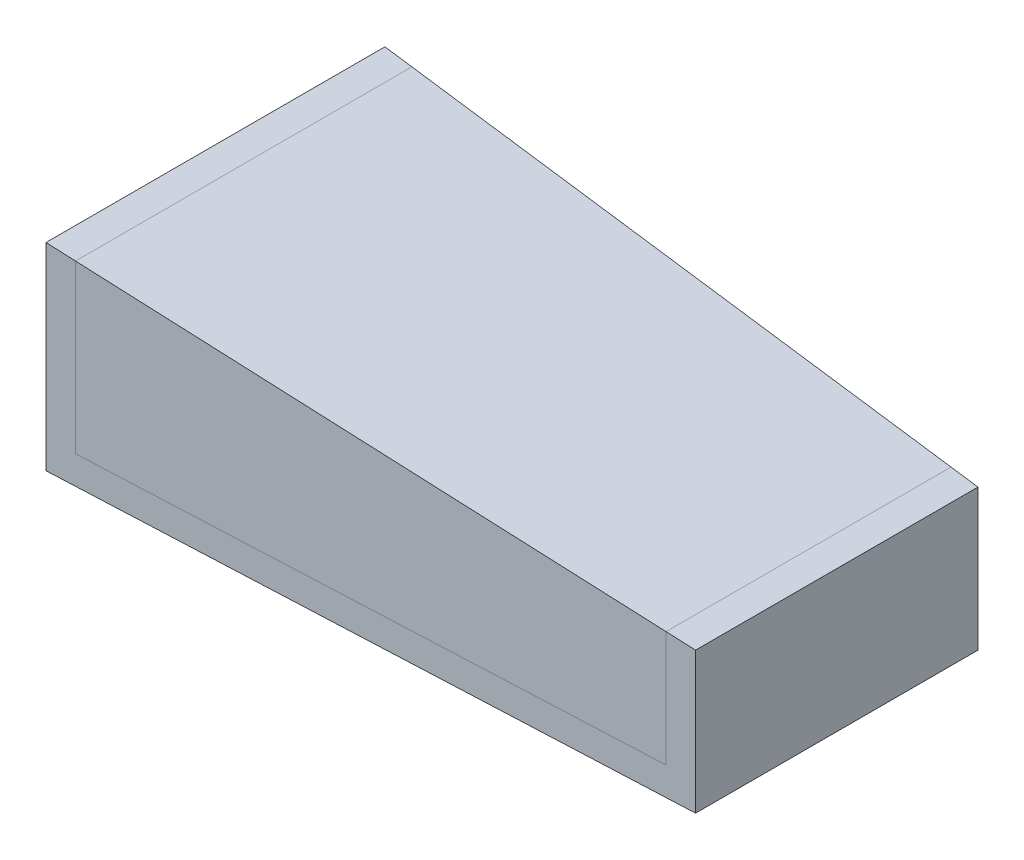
ISO-10303-21;
HEADER;
FILE_DESCRIPTION(('STEP AP214'),'2;1');
FILE_NAME('part.step','',(''),(''),'','','');
FILE_SCHEMA(('AUTOMOTIVE_DESIGN { 1 0 10303 214 1 1 1 1 }'));
ENDSEC;
DATA;
#1=APPLICATION_CONTEXT('core data for automotive mechanical design processes');
#2=APPLICATION_PROTOCOL_DEFINITION('international standard','automotive_design',2000,#1);
#3=PRODUCT_CONTEXT('',#1,'mechanical');
#4=PRODUCT('Part','Part','',(#3));
#5=PRODUCT_RELATED_PRODUCT_CATEGORY('part','',(#4));
#6=PRODUCT_DEFINITION_FORMATION('','',#4);
#7=PRODUCT_DEFINITION_CONTEXT('part definition',#1,'design');
#8=PRODUCT_DEFINITION('design','',#6,#7);
#9=PRODUCT_DEFINITION_SHAPE('','',#8);
#10=(LENGTH_UNIT() NAMED_UNIT(*) SI_UNIT(.MILLI.,.METRE.));
#11=(NAMED_UNIT(*) PLANE_ANGLE_UNIT() SI_UNIT($,.RADIAN.));
#12=(NAMED_UNIT(*) SI_UNIT($,.STERADIAN.) SOLID_ANGLE_UNIT());
#13=UNCERTAINTY_MEASURE_WITH_UNIT(LENGTH_MEASURE(1.E-05),#10,'distance_accuracy_value','');
#14=(GEOMETRIC_REPRESENTATION_CONTEXT(3) GLOBAL_UNCERTAINTY_ASSIGNED_CONTEXT((#13)) GLOBAL_UNIT_ASSIGNED_CONTEXT((#10,
#11,#12)) REPRESENTATION_CONTEXT('',''));
#15=CARTESIAN_POINT('',(0.,0.,0.));
#16=DIRECTION('',(0.,0.,1.));
#17=DIRECTION('',(1.,0.,0.));
#18=AXIS2_PLACEMENT_3D('',#15,#16,#17);
#19=CARTESIAN_POINT('',(9.99999999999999,10.,60.01));
#20=DIRECTION('',(0.,-1.,0.));
#21=DIRECTION('',(1.,0.,0.));
#22=AXIS2_PLACEMENT_3D('',#19,#20,#21);
#23=PLANE('',#22);
#24=DIRECTION('',(0.,0.,-1.));
#25=VECTOR('',#24,1.);
#26=CARTESIAN_POINT('',(210.,9.99999999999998,60.01));
#27=LINE('',#26,#25);
#28=CARTESIAN_POINT('',(210.,9.99999999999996,50.4545454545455));
#29=VERTEX_POINT('',#28);
#30=CARTESIAN_POINT('',(210.,9.99999999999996,-50.4545454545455));
#31=VERTEX_POINT('',#30);
#32=EDGE_CURVE('E12',#29,#31,#27,.T.);
#33=ORIENTED_EDGE('',*,*,#32,.F.);
#34=DIRECTION('',(-0.9989685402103,0.,0.04540766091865));
#35=VECTOR('',#34,1.);
#36=CARTESIAN_POINT('',(0.,9.99999999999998,60.));
#37=LINE('',#36,#35);
#38=CARTESIAN_POINT('',(9.99999999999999,9.99999999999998,59.5454545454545));
#39=VERTEX_POINT('',#38);
#40=EDGE_CURVE('E120',#29,#39,#37,.T.);
#41=ORIENTED_EDGE('',*,*,#40,.T.);
#42=DIRECTION('',(0.,0.,-1.));
#43=VECTOR('',#42,1.);
#44=CARTESIAN_POINT('',(9.99999999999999,10.,60.01));
#45=LINE('',#44,#43);
#46=CARTESIAN_POINT('',(9.99999999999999,9.99999999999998,-59.5454545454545));
#47=VERTEX_POINT('',#46);
#48=EDGE_CURVE('E64',#39,#47,#45,.T.);
#49=ORIENTED_EDGE('',*,*,#48,.T.);
#50=DIRECTION('',(-0.9989685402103,0.,-0.04540766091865));
#51=VECTOR('',#50,1.);
#52=CARTESIAN_POINT('',(0.,9.99999999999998,-60.));
#53=LINE('',#52,#51);
#54=EDGE_CURVE('E109',#31,#47,#53,.T.);
#55=ORIENTED_EDGE('',*,*,#54,.F.);
#56=EDGE_LOOP('',(#33,#41,#49,#55));
#57=FACE_BOUND('',#56,.T.);
#58=ADVANCED_FACE('F55',(#57),#23,.T.);
#59=CARTESIAN_POINT('',(210.,96.0285723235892,60.01));
#60=DIRECTION('',(1.,0.,0.));
#61=DIRECTION('',(0.,0.,-1.));
#62=AXIS2_PLACEMENT_3D('',#59,#60,#61);
#63=PLANE('',#62);
#64=DIRECTION('',(0.,0.,1.));
#65=VECTOR('',#64,1.);
#66=CARTESIAN_POINT('',(210.,50.9090909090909,60.));
#67=LINE('',#66,#65);
#68=CARTESIAN_POINT('',(210.,50.9090909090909,-50.4545454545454));
#69=VERTEX_POINT('',#68);
#70=CARTESIAN_POINT('',(210.,50.9090909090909,50.4545454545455));
#71=VERTEX_POINT('',#70);
#72=EDGE_CURVE('E114',#69,#71,#67,.T.);
#73=ORIENTED_EDGE('',*,*,#72,.T.);
#74=DIRECTION('',(0.,-1.,0.));
#75=VECTOR('',#74,1.);
#76=CARTESIAN_POINT('',(210.,120.,50.4545454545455));
#77=LINE('',#76,#75);
#78=EDGE_CURVE('E107',#71,#29,#77,.T.);
#79=ORIENTED_EDGE('',*,*,#78,.T.);
#80=ORIENTED_EDGE('',*,*,#32,.T.);
#81=DIRECTION('',(0.,-1.,0.));
#82=VECTOR('',#81,1.);
#83=CARTESIAN_POINT('',(210.,120.,-50.4545454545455));
#84=LINE('',#83,#82);
#85=EDGE_CURVE('E79',#69,#31,#84,.T.);
#86=ORIENTED_EDGE('',*,*,#85,.F.);
#87=EDGE_LOOP('',(#73,#79,#80,#86));
#88=FACE_BOUND('',#87,.T.);
#89=ADVANCED_FACE('F125',(#88),#63,.T.);
#90=CARTESIAN_POINT('',(10.,96.0285723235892,60.01));
#91=DIRECTION('',(-1.,0.,0.));
#92=DIRECTION('',(0.,-1.,0.));
#93=AXIS2_PLACEMENT_3D('',#90,#91,#92);
#94=PLANE('',#93);
#95=ORIENTED_EDGE('',*,*,#48,.F.);
#96=DIRECTION('',(0.,1.,0.));
#97=VECTOR('',#96,1.);
#98=CARTESIAN_POINT('',(10.,120.,59.5454545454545));
#99=LINE('',#98,#97);
#100=CARTESIAN_POINT('',(10.,69.0909090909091,59.5454545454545));
#101=VERTEX_POINT('',#100);
#102=EDGE_CURVE('E105',#39,#101,#99,.T.);
#103=ORIENTED_EDGE('',*,*,#102,.T.);
#104=DIRECTION('',(0.,0.,-1.));
#105=VECTOR('',#104,1.);
#106=CARTESIAN_POINT('',(10.,69.0909090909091,60.));
#107=LINE('',#106,#105);
#108=CARTESIAN_POINT('',(10.,69.0909090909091,-59.5454545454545));
#109=VERTEX_POINT('',#108);
#110=EDGE_CURVE('E111',#101,#109,#107,.T.);
#111=ORIENTED_EDGE('',*,*,#110,.T.);
#112=DIRECTION('',(0.,1.,0.));
#113=VECTOR('',#112,1.);
#114=CARTESIAN_POINT('',(10.,120.,-59.5454545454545));
#115=LINE('',#114,#113);
#116=EDGE_CURVE('E72',#47,#109,#115,.T.);
#117=ORIENTED_EDGE('',*,*,#116,.F.);
#118=EDGE_LOOP('',(#95,#103,#111,#117));
#119=FACE_BOUND('',#118,.T.);
#120=ADVANCED_FACE('F116',(#119),#94,.T.);
#121=CARTESIAN_POINT('',(0.,70.,60.));
#122=DIRECTION('',(-0.0905357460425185,-0.995893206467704,0.));
#123=DIRECTION('',(0.995893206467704,-0.0905357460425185,0.));
#124=AXIS2_PLACEMENT_3D('',#121,#122,#123);
#125=PLANE('',#124);
#126=ORIENTED_EDGE('',*,*,#110,.F.);
#127=DIRECTION('',(0.994874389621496,-0.0904431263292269,-0.0452215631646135));
#128=VECTOR('',#127,1.);
#129=CARTESIAN_POINT('',(0.,70.,60.));
#130=LINE('',#129,#128);
#131=EDGE_CURVE('E100',#101,#71,#130,.T.);
#132=ORIENTED_EDGE('',*,*,#131,.T.);
#133=ORIENTED_EDGE('',*,*,#72,.F.);
#134=DIRECTION('',(0.994874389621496,-0.0904431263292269,0.0452215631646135));
#135=VECTOR('',#134,1.);
#136=CARTESIAN_POINT('',(5.39877300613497,69.5092024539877,-59.7546012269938));
#137=LINE('',#136,#135);
#138=EDGE_CURVE('E59',#109,#69,#137,.T.);
#139=ORIENTED_EDGE('',*,*,#138,.F.);
#140=EDGE_LOOP('',(#126,#132,#133,#139));
#141=FACE_BOUND('',#140,.T.);
#142=ADVANCED_FACE('F112',(#141),#125,.F.);
#143=CARTESIAN_POINT('',(0.,120.,-60.));
#144=DIRECTION('',(0.04540766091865,0.,-0.9989685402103));
#145=DIRECTION('',(-0.9989685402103,0.,-0.04540766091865));
#146=AXIS2_PLACEMENT_3D('',#143,#144,#145);
#147=PLANE('',#146);
#148=ORIENTED_EDGE('',*,*,#54,.T.);
#149=ORIENTED_EDGE('',*,*,#116,.T.);
#150=ORIENTED_EDGE('',*,*,#138,.T.);
#151=ORIENTED_EDGE('',*,*,#85,.T.);
#152=EDGE_LOOP('',(#148,#149,#150,#151));
#153=FACE_BOUND('',#152,.T.);
#154=ADVANCED_FACE('F57',(#153),#147,.T.);
#155=CARTESIAN_POINT('',(0.,120.,60.));
#156=DIRECTION('',(-0.04540766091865,0.,-0.9989685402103));
#157=DIRECTION('',(-0.9989685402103,0.,0.04540766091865));
#158=AXIS2_PLACEMENT_3D('',#155,#156,#157);
#159=PLANE('',#158);
#160=ORIENTED_EDGE('',*,*,#102,.F.);
#161=ORIENTED_EDGE('',*,*,#40,.F.);
#162=ORIENTED_EDGE('',*,*,#78,.F.);
#163=ORIENTED_EDGE('',*,*,#131,.F.);
#164=EDGE_LOOP('',(#160,#161,#162,#163));
#165=FACE_BOUND('',#164,.T.);
#166=ADVANCED_FACE('F102',(#165),#159,.F.);
#167=CLOSED_SHELL('',(#58,#89,#120,#142,#154,#166));
#168=MANIFOLD_SOLID_BREP('B2',#167);
#169=CARTESIAN_POINT('',(9.99999999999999,10.,60.01));
#170=DIRECTION('',(0.,-1.,0.));
#171=DIRECTION('',(1.,0.,0.));
#172=AXIS2_PLACEMENT_3D('',#169,#170,#171);
#173=PLANE('',#172);
#174=DIRECTION('',(0.,0.,-1.));
#175=VECTOR('',#174,1.);
#176=CARTESIAN_POINT('',(210.,9.99999999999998,60.01));
#177=LINE('',#176,#175);
#178=CARTESIAN_POINT('',(210.,9.99999999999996,50.4545454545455));
#179=VERTEX_POINT('',#178);
#180=CARTESIAN_POINT('',(210.,9.99999999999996,-50.4545454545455));
#181=VERTEX_POINT('',#180);
#182=EDGE_CURVE('E53',#179,#181,#177,.T.);
#183=ORIENTED_EDGE('',*,*,#182,.T.);
#184=DIRECTION('',(-0.9989685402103,0.,-0.04540766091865));
#185=VECTOR('',#184,1.);
#186=CARTESIAN_POINT('',(0.,9.99999999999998,-60.));
#187=LINE('',#186,#185);
#188=CARTESIAN_POINT('',(9.99999999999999,9.99999999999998,-59.5454545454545));
#189=VERTEX_POINT('',#188);
#190=EDGE_CURVE('E286',#181,#189,#187,.T.);
#191=ORIENTED_EDGE('',*,*,#190,.T.);
#192=DIRECTION('',(0.,0.,-1.));
#193=VECTOR('',#192,1.);
#194=CARTESIAN_POINT('',(9.99999999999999,10.,60.01));
#195=LINE('',#194,#193);
#196=CARTESIAN_POINT('',(9.99999999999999,9.99999999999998,59.5454545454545));
#197=VERTEX_POINT('',#196);
#198=EDGE_CURVE('E192',#197,#189,#195,.T.);
#199=ORIENTED_EDGE('',*,*,#198,.F.);
#200=DIRECTION('',(-0.9989685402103,0.,0.04540766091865));
#201=VECTOR('',#200,1.);
#202=CARTESIAN_POINT('',(0.,9.99999999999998,60.));
#203=LINE('',#202,#201);
#204=EDGE_CURVE('E278',#179,#197,#203,.T.);
#205=ORIENTED_EDGE('',*,*,#204,.F.);
#206=EDGE_LOOP('',(#183,#191,#199,#205));
#207=FACE_BOUND('',#206,.T.);
#208=ADVANCED_FACE('F183',(#207),#173,.F.);
#209=CARTESIAN_POINT('',(210.,96.0285723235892,60.01));
#210=DIRECTION('',(1.,0.,0.));
#211=DIRECTION('',(0.,0.,-1.));
#212=AXIS2_PLACEMENT_3D('',#209,#210,#211);
#213=PLANE('',#212);
#214=DIRECTION('',(0.,0.,1.));
#215=VECTOR('',#214,1.);
#216=CARTESIAN_POINT('',(210.,50.9090909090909,60.));
#217=LINE('',#216,#215);
#218=CARTESIAN_POINT('',(210.,50.9090909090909,-50.4545454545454));
#219=VERTEX_POINT('',#218);
#220=CARTESIAN_POINT('',(210.,50.9090909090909,50.4545454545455));
#221=VERTEX_POINT('',#220);
#222=EDGE_CURVE('E295',#219,#221,#217,.T.);
#223=ORIENTED_EDGE('',*,*,#222,.F.);
#224=DIRECTION('',(0.,-1.,0.));
#225=VECTOR('',#224,1.);
#226=CARTESIAN_POINT('',(210.,120.,-50.4545454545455));
#227=LINE('',#226,#225);
#228=EDGE_CURVE('E208',#219,#181,#227,.T.);
#229=ORIENTED_EDGE('',*,*,#228,.T.);
#230=ORIENTED_EDGE('',*,*,#182,.F.);
#231=DIRECTION('',(0.,-1.,0.));
#232=VECTOR('',#231,1.);
#233=CARTESIAN_POINT('',(210.,120.,50.4545454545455));
#234=LINE('',#233,#232);
#235=EDGE_CURVE('E294',#221,#179,#234,.T.);
#236=ORIENTED_EDGE('',*,*,#235,.F.);
#237=EDGE_LOOP('',(#223,#229,#230,#236));
#238=FACE_BOUND('',#237,.T.);
#239=ADVANCED_FACE('F330',(#238),#213,.F.);
#240=CARTESIAN_POINT('',(10.,96.0285723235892,60.01));
#241=DIRECTION('',(-1.,0.,0.));
#242=DIRECTION('',(0.,-1.,0.));
#243=AXIS2_PLACEMENT_3D('',#240,#241,#242);
#244=PLANE('',#243);
#245=ORIENTED_EDGE('',*,*,#198,.T.);
#246=DIRECTION('',(0.,1.,0.));
#247=VECTOR('',#246,1.);
#248=CARTESIAN_POINT('',(10.,120.,-59.5454545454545));
#249=LINE('',#248,#247);
#250=CARTESIAN_POINT('',(10.,69.0909090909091,-59.5454545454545));
#251=VERTEX_POINT('',#250);
#252=EDGE_CURVE('E289',#189,#251,#249,.T.);
#253=ORIENTED_EDGE('',*,*,#252,.T.);
#254=DIRECTION('',(0.,0.,-1.));
#255=VECTOR('',#254,1.);
#256=CARTESIAN_POINT('',(10.,69.0909090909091,60.));
#257=LINE('',#256,#255);
#258=CARTESIAN_POINT('',(10.,69.0909090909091,59.5454545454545));
#259=VERTEX_POINT('',#258);
#260=EDGE_CURVE('E200',#259,#251,#257,.T.);
#261=ORIENTED_EDGE('',*,*,#260,.F.);
#262=DIRECTION('',(0.,1.,0.));
#263=VECTOR('',#262,1.);
#264=CARTESIAN_POINT('',(10.,120.,59.5454545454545));
#265=LINE('',#264,#263);
#266=EDGE_CURVE('E187',#197,#259,#265,.T.);
#267=ORIENTED_EDGE('',*,*,#266,.F.);
#268=EDGE_LOOP('',(#245,#253,#261,#267));
#269=FACE_BOUND('',#268,.T.);
#270=ADVANCED_FACE('F185',(#269),#244,.F.);
#271=CARTESIAN_POINT('',(0.,70.,60.));
#272=DIRECTION('',(-0.0905357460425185,-0.995893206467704,0.));
#273=DIRECTION('',(0.995893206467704,-0.0905357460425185,0.));
#274=AXIS2_PLACEMENT_3D('',#271,#272,#273);
#275=PLANE('',#274);
#276=DIRECTION('',(0.994874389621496,-0.0904431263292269,-0.0452215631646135));
#277=VECTOR('',#276,1.);
#278=CARTESIAN_POINT('',(0.,70.,60.));
#279=LINE('',#278,#277);
#280=CARTESIAN_POINT('',(0.,70.,60.));
#281=VERTEX_POINT('',#280);
#282=EDGE_CURVE('E304',#281,#259,#279,.T.);
#283=ORIENTED_EDGE('',*,*,#282,.T.);
#284=ORIENTED_EDGE('',*,*,#260,.T.);
#285=DIRECTION('',(0.994874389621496,-0.0904431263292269,0.0452215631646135));
#286=VECTOR('',#285,1.);
#287=CARTESIAN_POINT('',(5.39877300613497,69.5092024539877,-59.7546012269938));
#288=LINE('',#287,#286);
#289=CARTESIAN_POINT('',(0.,70.,-60.));
#290=VERTEX_POINT('',#289);
#291=EDGE_CURVE('E324',#290,#251,#288,.T.);
#292=ORIENTED_EDGE('',*,*,#291,.F.);
#293=DIRECTION('',(0.,0.,-1.));
#294=VECTOR('',#293,1.);
#295=CARTESIAN_POINT('',(0.,70.,60.));
#296=LINE('',#295,#294);
#297=EDGE_CURVE('E281',#281,#290,#296,.T.);
#298=ORIENTED_EDGE('',*,*,#297,.F.);
#299=EDGE_LOOP('',(#283,#284,#292,#298));
#300=FACE_BOUND('',#299,.T.);
#301=ADVANCED_FACE('F309',(#300),#275,.F.);
#302=CARTESIAN_POINT('',(0.,0.,60.));
#303=DIRECTION('',(0.,1.,0.));
#304=DIRECTION('',(0.,0.,1.));
#305=AXIS2_PLACEMENT_3D('',#302,#303,#304);
#306=PLANE('',#305);
#307=DIRECTION('',(0.9989685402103,0.,0.04540766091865));
#308=VECTOR('',#307,1.);
#309=CARTESIAN_POINT('',(0.,0.,-60.));
#310=LINE('',#309,#308);
#311=CARTESIAN_POINT('',(0.,0.,-60.));
#312=VERTEX_POINT('',#311);
#313=CARTESIAN_POINT('',(220.,0.,-50.));
#314=VERTEX_POINT('',#313);
#315=EDGE_CURVE('E254',#312,#314,#310,.T.);
#316=ORIENTED_EDGE('',*,*,#315,.T.);
#317=DIRECTION('',(0.,0.,-1.));
#318=VECTOR('',#317,1.);
#319=CARTESIAN_POINT('',(220.,0.,60.));
#320=LINE('',#319,#318);
#321=CARTESIAN_POINT('',(220.,0.,50.));
#322=VERTEX_POINT('',#321);
#323=EDGE_CURVE('E267',#322,#314,#320,.T.);
#324=ORIENTED_EDGE('',*,*,#323,.F.);
#325=DIRECTION('',(0.9989685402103,0.,-0.04540766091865));
#326=VECTOR('',#325,1.);
#327=CARTESIAN_POINT('',(0.,0.,60.));
#328=LINE('',#327,#326);
#329=CARTESIAN_POINT('',(0.,0.,60.));
#330=VERTEX_POINT('',#329);
#331=EDGE_CURVE('E323',#330,#322,#328,.T.);
#332=ORIENTED_EDGE('',*,*,#331,.F.);
#333=DIRECTION('',(0.,0.,-1.));
#334=VECTOR('',#333,1.);
#335=CARTESIAN_POINT('',(0.,0.,60.));
#336=LINE('',#335,#334);
#337=EDGE_CURVE('E269',#330,#312,#336,.T.);
#338=ORIENTED_EDGE('',*,*,#337,.T.);
#339=EDGE_LOOP('',(#316,#324,#332,#338));
#340=FACE_BOUND('',#339,.T.);
#341=ADVANCED_FACE('F265',(#340),#306,.F.);
#342=CARTESIAN_POINT('',(220.,50.,60.));
#343=DIRECTION('',(-1.,0.,0.));
#344=DIRECTION('',(0.,0.,1.));
#345=AXIS2_PLACEMENT_3D('',#342,#343,#344);
#346=PLANE('',#345);
#347=DIRECTION('',(0.,-1.,0.));
#348=VECTOR('',#347,1.);
#349=CARTESIAN_POINT('',(220.,120.,-50.));
#350=LINE('',#349,#348);
#351=CARTESIAN_POINT('',(220.,50.,-50.));
#352=VERTEX_POINT('',#351);
#353=EDGE_CURVE('E250',#352,#314,#350,.T.);
#354=ORIENTED_EDGE('',*,*,#353,.F.);
#355=DIRECTION('',(0.,0.,-1.));
#356=VECTOR('',#355,1.);
#357=CARTESIAN_POINT('',(220.,50.,60.));
#358=LINE('',#357,#356);
#359=CARTESIAN_POINT('',(220.,50.,50.));
#360=VERTEX_POINT('',#359);
#361=EDGE_CURVE('E276',#360,#352,#358,.T.);
#362=ORIENTED_EDGE('',*,*,#361,.F.);
#363=DIRECTION('',(0.,-1.,0.));
#364=VECTOR('',#363,1.);
#365=CARTESIAN_POINT('',(220.,120.,50.));
#366=LINE('',#365,#364);
#367=EDGE_CURVE('E275',#360,#322,#366,.T.);
#368=ORIENTED_EDGE('',*,*,#367,.T.);
#369=ORIENTED_EDGE('',*,*,#323,.T.);
#370=EDGE_LOOP('',(#354,#362,#368,#369));
#371=FACE_BOUND('',#370,.T.);
#372=ADVANCED_FACE('F273',(#371),#346,.F.);
#373=EDGE_CURVE('E257',#219,#352,#288,.T.);
#374=ORIENTED_EDGE('',*,*,#373,.F.);
#375=ORIENTED_EDGE('',*,*,#222,.T.);
#376=EDGE_CURVE('E313',#221,#360,#279,.T.);
#377=ORIENTED_EDGE('',*,*,#376,.T.);
#378=ORIENTED_EDGE('',*,*,#361,.T.);
#379=EDGE_LOOP('',(#374,#375,#377,#378));
#380=FACE_BOUND('',#379,.T.);
#381=ADVANCED_FACE('F332',(#380),#275,.F.);
#382=CARTESIAN_POINT('',(0.,70.,60.));
#383=DIRECTION('',(1.,0.,0.));
#384=DIRECTION('',(0.,1.,0.));
#385=AXIS2_PLACEMENT_3D('',#382,#383,#384);
#386=PLANE('',#385);
#387=DIRECTION('',(0.,-1.,0.));
#388=VECTOR('',#387,1.);
#389=CARTESIAN_POINT('',(0.,70.,-60.));
#390=LINE('',#389,#388);
#391=EDGE_CURVE('E312',#290,#312,#390,.T.);
#392=ORIENTED_EDGE('',*,*,#391,.T.);
#393=ORIENTED_EDGE('',*,*,#337,.F.);
#394=DIRECTION('',(0.,-1.,0.));
#395=VECTOR('',#394,1.);
#396=CARTESIAN_POINT('',(0.,70.,60.));
#397=LINE('',#396,#395);
#398=EDGE_CURVE('E315',#281,#330,#397,.T.);
#399=ORIENTED_EDGE('',*,*,#398,.F.);
#400=ORIENTED_EDGE('',*,*,#297,.T.);
#401=EDGE_LOOP('',(#392,#393,#399,#400));
#402=FACE_BOUND('',#401,.T.);
#403=ADVANCED_FACE('F322',(#402),#386,.F.);
#404=CARTESIAN_POINT('',(0.,120.,60.));
#405=DIRECTION('',(-0.04540766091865,0.,-0.9989685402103));
#406=DIRECTION('',(-0.9989685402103,0.,0.04540766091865));
#407=AXIS2_PLACEMENT_3D('',#404,#405,#406);
#408=PLANE('',#407);
#409=ORIENTED_EDGE('',*,*,#204,.T.);
#410=ORIENTED_EDGE('',*,*,#266,.T.);
#411=ORIENTED_EDGE('',*,*,#282,.F.);
#412=ORIENTED_EDGE('',*,*,#398,.T.);
#413=ORIENTED_EDGE('',*,*,#331,.T.);
#414=ORIENTED_EDGE('',*,*,#367,.F.);
#415=ORIENTED_EDGE('',*,*,#376,.F.);
#416=ORIENTED_EDGE('',*,*,#235,.T.);
#417=EDGE_LOOP('',(#409,#410,#411,#412,#413,#414,#415,#416));
#418=FACE_BOUND('',#417,.T.);
#419=ADVANCED_FACE('F303',(#418),#408,.F.);
#420=CARTESIAN_POINT('',(0.,120.,-60.));
#421=DIRECTION('',(0.04540766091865,0.,-0.9989685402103));
#422=DIRECTION('',(-0.9989685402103,0.,-0.04540766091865));
#423=AXIS2_PLACEMENT_3D('',#420,#421,#422);
#424=PLANE('',#423);
#425=ORIENTED_EDGE('',*,*,#252,.F.);
#426=ORIENTED_EDGE('',*,*,#190,.F.);
#427=ORIENTED_EDGE('',*,*,#228,.F.);
#428=ORIENTED_EDGE('',*,*,#373,.T.);
#429=ORIENTED_EDGE('',*,*,#353,.T.);
#430=ORIENTED_EDGE('',*,*,#315,.F.);
#431=ORIENTED_EDGE('',*,*,#391,.F.);
#432=ORIENTED_EDGE('',*,*,#291,.T.);
#433=EDGE_LOOP('',(#425,#426,#427,#428,#429,#430,#431,#432));
#434=FACE_BOUND('',#433,.T.);
#435=ADVANCED_FACE('F253',(#434),#424,.T.);
#436=CLOSED_SHELL('',(#208,#239,#270,#301,#341,#372,#381,#403,#419,#435));
#437=MANIFOLD_SOLID_BREP('B6',#436);
#438=ADVANCED_BREP_SHAPE_REPRESENTATION('',(#18,#168,#437),#14);
#439=SHAPE_DEFINITION_REPRESENTATION(#9,#438);
ENDSEC;
END-ISO-10303-21;
